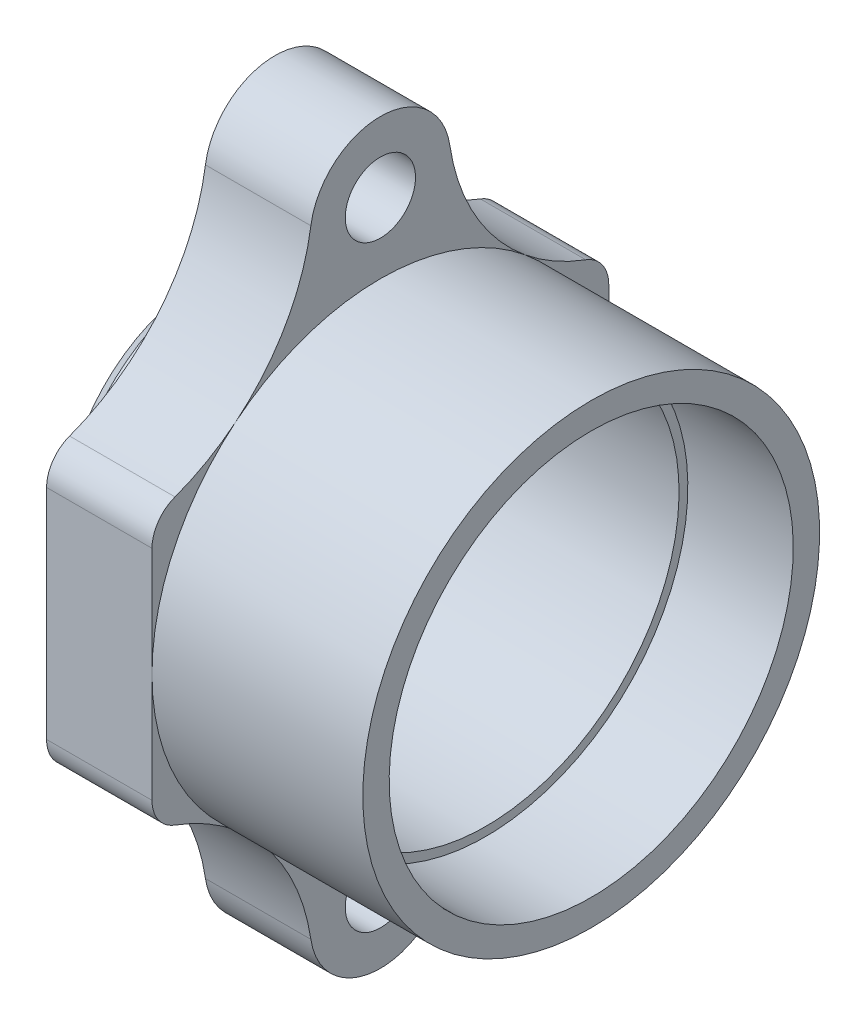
ISO-10303-21;
HEADER;
FILE_DESCRIPTION(('STEP AP214'),'2;1');
FILE_NAME('part.step','',(''),(''),'','','');
FILE_SCHEMA(('AUTOMOTIVE_DESIGN { 1 0 10303 214 1 1 1 1 }'));
ENDSEC;
DATA;
#1=APPLICATION_CONTEXT('core data for automotive mechanical design processes');
#2=APPLICATION_PROTOCOL_DEFINITION('international standard','automotive_design',2000,#1);
#3=PRODUCT_CONTEXT('',#1,'mechanical');
#4=PRODUCT('Part','Part','',(#3));
#5=PRODUCT_RELATED_PRODUCT_CATEGORY('part','',(#4));
#6=PRODUCT_DEFINITION_FORMATION('','',#4);
#7=PRODUCT_DEFINITION_CONTEXT('part definition',#1,'design');
#8=PRODUCT_DEFINITION('design','',#6,#7);
#9=PRODUCT_DEFINITION_SHAPE('','',#8);
#10=(LENGTH_UNIT() NAMED_UNIT(*) SI_UNIT(.MILLI.,.METRE.));
#11=(NAMED_UNIT(*) PLANE_ANGLE_UNIT() SI_UNIT($,.RADIAN.));
#12=(NAMED_UNIT(*) SI_UNIT($,.STERADIAN.) SOLID_ANGLE_UNIT());
#13=UNCERTAINTY_MEASURE_WITH_UNIT(LENGTH_MEASURE(1.E-05),#10,'distance_accuracy_value','');
#14=(GEOMETRIC_REPRESENTATION_CONTEXT(3) GLOBAL_UNCERTAINTY_ASSIGNED_CONTEXT((#13)) GLOBAL_UNIT_ASSIGNED_CONTEXT((#10,
#11,#12)) REPRESENTATION_CONTEXT('',''));
#15=CARTESIAN_POINT('',(0.,0.,0.));
#16=DIRECTION('',(0.,0.,1.));
#17=DIRECTION('',(1.,0.,0.));
#18=AXIS2_PLACEMENT_3D('',#15,#16,#17);
#19=CARTESIAN_POINT('',(-3.3,4.25,0.));
#20=DIRECTION('',(-1.,0.,0.));
#21=DIRECTION('',(0.,-1.,0.));
#22=AXIS2_PLACEMENT_3D('',#19,#20,#21);
#23=PLANE('',#22);
#24=CARTESIAN_POINT('',(-3.3,6.25,0.));
#25=DIRECTION('',(-1.,0.,0.));
#26=DIRECTION('',(0.,1.,0.));
#27=AXIS2_PLACEMENT_3D('',#24,#25,#26);
#28=CIRCLE('',#27,2.);
#29=CARTESIAN_POINT('',(-3.3,6.54411764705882,1.97825549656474));
#30=VERTEX_POINT('',#29);
#31=CARTESIAN_POINT('',(-3.3,6.54411764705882,-1.97825549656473));
#32=VERTEX_POINT('',#31);
#33=EDGE_CURVE('E183',#30,#32,#28,.T.);
#34=ORIENTED_EDGE('',*,*,#33,.T.);
#35=CARTESIAN_POINT('',(-3.3,7.4264705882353,-7.91302198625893));
#36=DIRECTION('',(1.,0.,0.));
#37=DIRECTION('',(0.,-1.,0.));
#38=AXIS2_PLACEMENT_3D('',#35,#36,#37);
#39=CIRCLE('',#38,6.);
#40=CARTESIAN_POINT('',(-3.3,1.7942315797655,-5.84471742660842));
#41=VERTEX_POINT('',#40);
#42=EDGE_CURVE('E156',#32,#41,#39,.T.);
#43=ORIENTED_EDGE('',*,*,#42,.T.);
#44=CARTESIAN_POINT('',(-3.3,0.855525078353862,-5.5));
#45=DIRECTION('',(-1.,0.,0.));
#46=DIRECTION('',(0.,1.,0.));
#47=AXIS2_PLACEMENT_3D('',#44,#45,#46);
#48=CIRCLE('',#47,1.);
#49=CARTESIAN_POINT('',(-3.3,0.855525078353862,-6.5));
#50=VERTEX_POINT('',#49);
#51=EDGE_CURVE('E136',#41,#50,#48,.T.);
#52=ORIENTED_EDGE('',*,*,#51,.T.);
#53=DIRECTION('',(0.,-1.,0.));
#54=VECTOR('',#53,1.);
#55=CARTESIAN_POINT('',(-3.3,0.855525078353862,-6.5));
#56=LINE('',#55,#54);
#57=CARTESIAN_POINT('',(-3.3,-5.35552507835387,-6.5));
#58=VERTEX_POINT('',#57);
#59=EDGE_CURVE('E146',#50,#58,#56,.T.);
#60=ORIENTED_EDGE('',*,*,#59,.T.);
#61=CARTESIAN_POINT('',(-3.3,-5.35552507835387,-5.5));
#62=DIRECTION('',(-1.,0.,0.));
#63=DIRECTION('',(0.,-1.,0.));
#64=AXIS2_PLACEMENT_3D('',#61,#62,#63);
#65=CIRCLE('',#64,1.);
#66=CARTESIAN_POINT('',(-3.3,-6.2942315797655,-5.84471742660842));
#67=VERTEX_POINT('',#66);
#68=EDGE_CURVE('E152',#58,#67,#65,.T.);
#69=ORIENTED_EDGE('',*,*,#68,.T.);
#70=CARTESIAN_POINT('',(-3.3,-11.9264705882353,-7.91302198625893));
#71=DIRECTION('',(1.,0.,0.));
#72=DIRECTION('',(0.,1.,0.));
#73=AXIS2_PLACEMENT_3D('',#70,#71,#72);
#74=CIRCLE('',#73,6.);
#75=CARTESIAN_POINT('',(-3.3,-11.0441176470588,-1.97825549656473));
#76=VERTEX_POINT('',#75);
#77=EDGE_CURVE('E166',#67,#76,#74,.T.);
#78=ORIENTED_EDGE('',*,*,#77,.T.);
#79=CARTESIAN_POINT('',(-3.3,-10.75,0.));
#80=DIRECTION('',(-1.,0.,0.));
#81=DIRECTION('',(0.,-1.,0.));
#82=AXIS2_PLACEMENT_3D('',#79,#80,#81);
#83=CIRCLE('',#82,2.);
#84=CARTESIAN_POINT('',(-3.3,-11.0441176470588,1.97825549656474));
#85=VERTEX_POINT('',#84);
#86=EDGE_CURVE('E168',#76,#85,#83,.T.);
#87=ORIENTED_EDGE('',*,*,#86,.T.);
#88=CARTESIAN_POINT('',(-3.3,-11.9264705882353,7.91302198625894));
#89=DIRECTION('',(1.,0.,0.));
#90=DIRECTION('',(0.,-1.,0.));
#91=AXIS2_PLACEMENT_3D('',#88,#89,#90);
#92=CIRCLE('',#91,6.);
#93=CARTESIAN_POINT('',(-3.3,-6.2942315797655,5.84471742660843));
#94=VERTEX_POINT('',#93);
#95=EDGE_CURVE('E171',#85,#94,#92,.T.);
#96=ORIENTED_EDGE('',*,*,#95,.T.);
#97=CARTESIAN_POINT('',(-3.3,-5.35552507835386,5.5));
#98=DIRECTION('',(-1.,0.,0.));
#99=DIRECTION('',(0.,1.,0.));
#100=AXIS2_PLACEMENT_3D('',#97,#98,#99);
#101=CIRCLE('',#100,1.);
#102=CARTESIAN_POINT('',(-3.3,-5.35552507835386,6.5));
#103=VERTEX_POINT('',#102);
#104=EDGE_CURVE('E173',#94,#103,#101,.T.);
#105=ORIENTED_EDGE('',*,*,#104,.T.);
#106=DIRECTION('',(0.,1.,0.));
#107=VECTOR('',#106,1.);
#108=CARTESIAN_POINT('',(-3.3,0.85552507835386,6.5));
#109=LINE('',#108,#107);
#110=CARTESIAN_POINT('',(-3.3,0.85552507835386,6.5));
#111=VERTEX_POINT('',#110);
#112=EDGE_CURVE('E176',#103,#111,#109,.T.);
#113=ORIENTED_EDGE('',*,*,#112,.T.);
#114=CARTESIAN_POINT('',(-3.3,0.85552507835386,5.5));
#115=DIRECTION('',(-1.,0.,0.));
#116=DIRECTION('',(0.,-1.,0.));
#117=AXIS2_PLACEMENT_3D('',#114,#115,#116);
#118=CIRCLE('',#117,1.);
#119=CARTESIAN_POINT('',(-3.3,1.79423157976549,5.84471742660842));
#120=VERTEX_POINT('',#119);
#121=EDGE_CURVE('E178',#111,#120,#118,.T.);
#122=ORIENTED_EDGE('',*,*,#121,.T.);
#123=CARTESIAN_POINT('',(-3.3,7.42647058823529,7.91302198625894));
#124=DIRECTION('',(1.,0.,0.));
#125=DIRECTION('',(0.,1.,0.));
#126=AXIS2_PLACEMENT_3D('',#123,#124,#125);
#127=CIRCLE('',#126,6.);
#128=EDGE_CURVE('E181',#120,#30,#127,.T.);
#129=ORIENTED_EDGE('',*,*,#128,.T.);
#130=EDGE_LOOP('',(#34,#43,#52,#60,#69,#78,#87,#96,#105,#113,#122,#129));
#131=FACE_BOUND('',#130,.T.);
#132=CARTESIAN_POINT('',(-3.3,6.25,0.));
#133=DIRECTION('',(-1.,0.,0.));
#134=DIRECTION('',(0.,1.,0.));
#135=AXIS2_PLACEMENT_3D('',#132,#133,#134);
#136=CIRCLE('',#135,0.999999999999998);
#137=CARTESIAN_POINT('',(-3.3,7.25,0.));
#138=VERTEX_POINT('',#137);
#139=EDGE_CURVE('E506',#138,#138,#136,.T.);
#140=ORIENTED_EDGE('',*,*,#139,.F.);
#141=EDGE_LOOP('',(#140));
#142=FACE_BOUND('',#141,.T.);
#143=CARTESIAN_POINT('',(-3.3,-10.75,0.));
#144=DIRECTION('',(-1.,0.,0.));
#145=DIRECTION('',(0.,-1.,0.));
#146=AXIS2_PLACEMENT_3D('',#143,#144,#145);
#147=CIRCLE('',#146,0.999999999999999);
#148=CARTESIAN_POINT('',(-3.3,-11.75,0.));
#149=VERTEX_POINT('',#148);
#150=EDGE_CURVE('E161',#149,#149,#147,.T.);
#151=ORIENTED_EDGE('',*,*,#150,.F.);
#152=EDGE_LOOP('',(#151));
#153=FACE_BOUND('',#152,.T.);
#154=CARTESIAN_POINT('',(-3.3,-2.25,0.));
#155=DIRECTION('',(1.,0.,0.));
#156=DIRECTION('',(0.,1.,0.));
#157=AXIS2_PLACEMENT_3D('',#154,#155,#156);
#158=CIRCLE('',#157,4.5);
#159=CARTESIAN_POINT('',(-3.3,2.25,0.));
#160=VERTEX_POINT('',#159);
#161=EDGE_CURVE('E255',#160,#160,#158,.T.);
#162=ORIENTED_EDGE('',*,*,#161,.T.);
#163=EDGE_LOOP('',(#162));
#164=FACE_BOUND('',#163,.T.);
#165=ADVANCED_FACE('F27',(#131,#142,#153,#164),#23,.T.);
#166=CARTESIAN_POINT('',(8.31355509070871,-2.25,0.));
#167=DIRECTION('',(1.,0.,0.));
#168=DIRECTION('',(0.,1.,0.));
#169=AXIS2_PLACEMENT_3D('',#166,#167,#168);
#170=CYLINDRICAL_SURFACE('',#169,6.5);
#171=CARTESIAN_POINT('',(-0.300000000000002,-2.25,0.));
#172=DIRECTION('',(1.,0.,0.));
#173=DIRECTION('',(0.,1.,0.));
#174=AXIS2_PLACEMENT_3D('',#171,#172,#173);
#175=CIRCLE('',#174,6.5);
#176=CARTESIAN_POINT('',(-0.300000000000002,2.78176470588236,-4.11477143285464));
#177=VERTEX_POINT('',#176);
#178=CARTESIAN_POINT('',(-0.300000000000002,-2.25,-6.5));
#179=VERTEX_POINT('',#178);
#180=EDGE_CURVE('E254',#177,#179,#175,.F.);
#181=ORIENTED_EDGE('',*,*,#180,.F.);
#182=CARTESIAN_POINT('',(-0.300000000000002,2.78176470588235,4.11477143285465));
#183=VERTEX_POINT('',#182);
#184=EDGE_CURVE('E226',#183,#177,#175,.F.);
#185=ORIENTED_EDGE('',*,*,#184,.F.);
#186=CARTESIAN_POINT('',(-0.300000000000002,-2.25,6.5));
#187=VERTEX_POINT('',#186);
#188=EDGE_CURVE('E253',#187,#183,#175,.F.);
#189=ORIENTED_EDGE('',*,*,#188,.F.);
#190=CARTESIAN_POINT('',(-0.3,-7.28176470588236,4.11477143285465));
#191=VERTEX_POINT('',#190);
#192=EDGE_CURVE('E533',#191,#187,#175,.F.);
#193=ORIENTED_EDGE('',*,*,#192,.F.);
#194=CARTESIAN_POINT('',(-0.3,-7.28176470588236,-4.11477143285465));
#195=VERTEX_POINT('',#194);
#196=EDGE_CURVE('E46',#195,#191,#175,.F.);
#197=ORIENTED_EDGE('',*,*,#196,.F.);
#198=EDGE_CURVE('E41',#179,#195,#175,.F.);
#199=ORIENTED_EDGE('',*,*,#198,.F.);
#200=EDGE_LOOP('',(#181,#185,#189,#193,#197,#199));
#201=FACE_BOUND('',#200,.T.);
#202=CARTESIAN_POINT('',(5.7,-2.25,0.));
#203=DIRECTION('',(1.,0.,0.));
#204=DIRECTION('',(0.,1.,0.));
#205=AXIS2_PLACEMENT_3D('',#202,#203,#204);
#206=CIRCLE('',#205,6.5);
#207=CARTESIAN_POINT('',(5.7,4.25,0.));
#208=VERTEX_POINT('',#207);
#209=EDGE_CURVE('E276',#208,#208,#206,.T.);
#210=ORIENTED_EDGE('',*,*,#209,.F.);
#211=EDGE_LOOP('',(#210));
#212=FACE_BOUND('',#211,.T.);
#213=ADVANCED_FACE('F301',(#201,#212),#170,.T.);
#214=CARTESIAN_POINT('',(5.7,4.25,0.));
#215=DIRECTION('',(1.,0.,0.));
#216=DIRECTION('',(0.,1.,0.));
#217=AXIS2_PLACEMENT_3D('',#214,#215,#216);
#218=PLANE('',#217);
#219=ORIENTED_EDGE('',*,*,#209,.T.);
#220=EDGE_LOOP('',(#219));
#221=FACE_BOUND('',#220,.T.);
#222=CARTESIAN_POINT('',(5.7,-2.25,0.));
#223=DIRECTION('',(1.,0.,0.));
#224=DIRECTION('',(0.,1.,0.));
#225=AXIS2_PLACEMENT_3D('',#222,#223,#224);
#226=CIRCLE('',#225,5.75);
#227=CARTESIAN_POINT('',(5.7,3.5,0.));
#228=VERTEX_POINT('',#227);
#229=EDGE_CURVE('E273',#228,#228,#226,.T.);
#230=ORIENTED_EDGE('',*,*,#229,.F.);
#231=EDGE_LOOP('',(#230));
#232=FACE_BOUND('',#231,.T.);
#233=ADVANCED_FACE('F305',(#221,#232),#218,.T.);
#234=CARTESIAN_POINT('',(8.31355509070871,-2.25,0.));
#235=DIRECTION('',(1.,0.,0.));
#236=DIRECTION('',(0.,1.,0.));
#237=AXIS2_PLACEMENT_3D('',#234,#235,#236);
#238=CYLINDRICAL_SURFACE('',#237,5.75);
#239=ORIENTED_EDGE('',*,*,#229,.T.);
#240=EDGE_LOOP('',(#239));
#241=FACE_BOUND('',#240,.T.);
#242=CARTESIAN_POINT('',(2.7,-2.25,0.));
#243=DIRECTION('',(1.,0.,0.));
#244=DIRECTION('',(0.,1.,0.));
#245=AXIS2_PLACEMENT_3D('',#242,#243,#244);
#246=CIRCLE('',#245,5.75);
#247=CARTESIAN_POINT('',(2.7,3.5,0.));
#248=VERTEX_POINT('',#247);
#249=EDGE_CURVE('E270',#248,#248,#246,.T.);
#250=ORIENTED_EDGE('',*,*,#249,.F.);
#251=EDGE_LOOP('',(#250));
#252=FACE_BOUND('',#251,.T.);
#253=ADVANCED_FACE('F310',(#241,#252),#238,.F.);
#254=CARTESIAN_POINT('',(2.7,3.5,0.));
#255=DIRECTION('',(1.,0.,0.));
#256=DIRECTION('',(0.,1.,0.));
#257=AXIS2_PLACEMENT_3D('',#254,#255,#256);
#258=PLANE('',#257);
#259=ORIENTED_EDGE('',*,*,#249,.T.);
#260=EDGE_LOOP('',(#259));
#261=FACE_BOUND('',#260,.T.);
#262=CARTESIAN_POINT('',(2.7,-2.25,0.));
#263=DIRECTION('',(1.,0.,0.));
#264=DIRECTION('',(0.,1.,0.));
#265=AXIS2_PLACEMENT_3D('',#262,#263,#264);
#266=CIRCLE('',#265,5.5);
#267=CARTESIAN_POINT('',(2.7,3.25,0.));
#268=VERTEX_POINT('',#267);
#269=EDGE_CURVE('E267',#268,#268,#266,.T.);
#270=ORIENTED_EDGE('',*,*,#269,.F.);
#271=EDGE_LOOP('',(#270));
#272=FACE_BOUND('',#271,.T.);
#273=ADVANCED_FACE('F317',(#261,#272),#258,.T.);
#274=CARTESIAN_POINT('',(8.31355509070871,-2.25,0.));
#275=DIRECTION('',(1.,0.,0.));
#276=DIRECTION('',(0.,1.,0.));
#277=AXIS2_PLACEMENT_3D('',#274,#275,#276);
#278=CYLINDRICAL_SURFACE('',#277,5.5);
#279=ORIENTED_EDGE('',*,*,#269,.T.);
#280=EDGE_LOOP('',(#279));
#281=FACE_BOUND('',#280,.T.);
#282=CARTESIAN_POINT('',(-2.3,-2.25,0.));
#283=DIRECTION('',(1.,0.,0.));
#284=DIRECTION('',(0.,1.,0.));
#285=AXIS2_PLACEMENT_3D('',#282,#283,#284);
#286=CIRCLE('',#285,5.5);
#287=CARTESIAN_POINT('',(-2.3,3.25,0.));
#288=VERTEX_POINT('',#287);
#289=EDGE_CURVE('E264',#288,#288,#286,.T.);
#290=ORIENTED_EDGE('',*,*,#289,.F.);
#291=EDGE_LOOP('',(#290));
#292=FACE_BOUND('',#291,.T.);
#293=ADVANCED_FACE('F321',(#281,#292),#278,.F.);
#294=CARTESIAN_POINT('',(-2.3,3.25,0.));
#295=DIRECTION('',(1.,0.,0.));
#296=DIRECTION('',(0.,1.,0.));
#297=AXIS2_PLACEMENT_3D('',#294,#295,#296);
#298=PLANE('',#297);
#299=ORIENTED_EDGE('',*,*,#289,.T.);
#300=EDGE_LOOP('',(#299));
#301=FACE_BOUND('',#300,.T.);
#302=CARTESIAN_POINT('',(-2.3,-2.25,0.));
#303=DIRECTION('',(1.,0.,0.));
#304=DIRECTION('',(0.,1.,0.));
#305=AXIS2_PLACEMENT_3D('',#302,#303,#304);
#306=CIRCLE('',#305,3.);
#307=CARTESIAN_POINT('',(-2.3,0.75,0.));
#308=VERTEX_POINT('',#307);
#309=EDGE_CURVE('E261',#308,#308,#306,.T.);
#310=ORIENTED_EDGE('',*,*,#309,.F.);
#311=EDGE_LOOP('',(#310));
#312=FACE_BOUND('',#311,.T.);
#313=ADVANCED_FACE('F324',(#301,#312),#298,.T.);
#314=CARTESIAN_POINT('',(8.31355509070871,-2.25,0.));
#315=DIRECTION('',(1.,0.,0.));
#316=DIRECTION('',(0.,1.,0.));
#317=AXIS2_PLACEMENT_3D('',#314,#315,#316);
#318=CYLINDRICAL_SURFACE('',#317,3.);
#319=ORIENTED_EDGE('',*,*,#309,.T.);
#320=EDGE_LOOP('',(#319));
#321=FACE_BOUND('',#320,.T.);
#322=CARTESIAN_POINT('',(-5.3,-2.25,0.));
#323=DIRECTION('',(1.,0.,0.));
#324=DIRECTION('',(0.,1.,0.));
#325=AXIS2_PLACEMENT_3D('',#322,#323,#324);
#326=CIRCLE('',#325,3.);
#327=CARTESIAN_POINT('',(-5.3,0.749999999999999,0.));
#328=VERTEX_POINT('',#327);
#329=EDGE_CURVE('E258',#328,#328,#326,.T.);
#330=ORIENTED_EDGE('',*,*,#329,.F.);
#331=EDGE_LOOP('',(#330));
#332=FACE_BOUND('',#331,.T.);
#333=ADVANCED_FACE('F328',(#321,#332),#318,.F.);
#334=CARTESIAN_POINT('',(-5.3,2.25,0.));
#335=DIRECTION('',(-1.,0.,0.));
#336=DIRECTION('',(0.,-1.,0.));
#337=AXIS2_PLACEMENT_3D('',#334,#335,#336);
#338=PLANE('',#337);
#339=CARTESIAN_POINT('',(-5.3,-2.25,0.));
#340=DIRECTION('',(-1.,0.,0.));
#341=DIRECTION('',(0.,-1.,0.));
#342=AXIS2_PLACEMENT_3D('',#339,#340,#341);
#343=CIRCLE('',#342,4.);
#344=CARTESIAN_POINT('',(-5.3,-6.25,0.));
#345=VERTEX_POINT('',#344);
#346=EDGE_CURVE('E11',#345,#345,#343,.T.);
#347=ORIENTED_EDGE('',*,*,#346,.T.);
#348=EDGE_LOOP('',(#347));
#349=FACE_BOUND('',#348,.T.);
#350=ORIENTED_EDGE('',*,*,#329,.T.);
#351=EDGE_LOOP('',(#350));
#352=FACE_BOUND('',#351,.T.);
#353=ADVANCED_FACE('F297',(#349,#352),#338,.T.);
#354=CARTESIAN_POINT('',(8.31355509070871,-2.25,0.));
#355=DIRECTION('',(1.,0.,0.));
#356=DIRECTION('',(0.,1.,0.));
#357=AXIS2_PLACEMENT_3D('',#354,#355,#356);
#358=CYLINDRICAL_SURFACE('',#357,4.5);
#359=CARTESIAN_POINT('',(-4.8,-2.25,0.));
#360=DIRECTION('',(-1.,0.,0.));
#361=DIRECTION('',(0.,0.,1.));
#362=AXIS2_PLACEMENT_3D('',#359,#360,#361);
#363=CIRCLE('',#362,4.5);
#364=CARTESIAN_POINT('',(-4.8,-2.25,4.5));
#365=VERTEX_POINT('',#364);
#366=EDGE_CURVE('E34',#365,#365,#363,.F.);
#367=ORIENTED_EDGE('',*,*,#366,.T.);
#368=EDGE_LOOP('',(#367));
#369=FACE_BOUND('',#368,.T.);
#370=ORIENTED_EDGE('',*,*,#161,.F.);
#371=EDGE_LOOP('',(#370));
#372=FACE_BOUND('',#371,.T.);
#373=ADVANCED_FACE('F281',(#369,#372),#358,.T.);
#374=CARTESIAN_POINT('',(-4.8,-2.25,0.));
#375=DIRECTION('',(1.,0.,0.));
#376=DIRECTION('',(0.,0.,-1.));
#377=AXIS2_PLACEMENT_3D('',#374,#375,#376);
#378=CONICAL_SURFACE('',#377,4.5,0.785398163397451);
#379=ORIENTED_EDGE('',*,*,#346,.F.);
#380=EDGE_LOOP('',(#379));
#381=FACE_BOUND('',#380,.T.);
#382=ORIENTED_EDGE('',*,*,#366,.F.);
#383=EDGE_LOOP('',(#382));
#384=FACE_BOUND('',#383,.T.);
#385=ADVANCED_FACE('F284',(#381,#384),#378,.T.);
#386=CARTESIAN_POINT('',(-0.300000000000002,7.4264705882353,-7.91302198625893));
#387=DIRECTION('',(-1.,0.,0.));
#388=DIRECTION('',(0.,-1.,0.));
#389=AXIS2_PLACEMENT_3D('',#386,#387,#388);
#390=CYLINDRICAL_SURFACE('',#389,6.);
#391=ORIENTED_EDGE('',*,*,#42,.F.);
#392=DIRECTION('',(-1.,0.,0.));
#393=VECTOR('',#392,1.);
#394=CARTESIAN_POINT('',(-0.300000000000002,6.54411764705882,-1.97825549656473));
#395=LINE('',#394,#393);
#396=CARTESIAN_POINT('',(-0.300000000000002,6.54411764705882,-1.97825549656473));
#397=VERTEX_POINT('',#396);
#398=EDGE_CURVE('E227',#397,#32,#395,.T.);
#399=ORIENTED_EDGE('',*,*,#398,.F.);
#400=CARTESIAN_POINT('',(-0.300000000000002,7.4264705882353,-7.91302198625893));
#401=DIRECTION('',(1.,0.,0.));
#402=DIRECTION('',(0.,-1.,0.));
#403=AXIS2_PLACEMENT_3D('',#400,#401,#402);
#404=CIRCLE('',#403,6.);
#405=EDGE_CURVE('E143',#397,#177,#404,.T.);
#406=ORIENTED_EDGE('',*,*,#405,.T.);
#407=CARTESIAN_POINT('',(-0.300000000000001,1.7942315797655,-5.84471742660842));
#408=VERTEX_POINT('',#407);
#409=EDGE_CURVE('E221',#177,#408,#404,.T.);
#410=ORIENTED_EDGE('',*,*,#409,.T.);
#411=DIRECTION('',(-1.,0.,0.));
#412=VECTOR('',#411,1.);
#413=CARTESIAN_POINT('',(-0.300000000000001,1.7942315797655,-5.84471742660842));
#414=LINE('',#413,#412);
#415=EDGE_CURVE('E224',#408,#41,#414,.T.);
#416=ORIENTED_EDGE('',*,*,#415,.T.);
#417=EDGE_LOOP('',(#391,#399,#406,#410,#416));
#418=FACE_BOUND('',#417,.T.);
#419=ADVANCED_FACE('F286',(#418),#390,.F.);
#420=CARTESIAN_POINT('',(-0.300000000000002,7.42647058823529,7.91302198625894));
#421=DIRECTION('',(-1.,0.,0.));
#422=DIRECTION('',(0.,-1.,0.));
#423=AXIS2_PLACEMENT_3D('',#420,#421,#422);
#424=CYLINDRICAL_SURFACE('',#423,6.);
#425=DIRECTION('',(-1.,0.,0.));
#426=VECTOR('',#425,1.);
#427=CARTESIAN_POINT('',(-0.300000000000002,6.54411764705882,1.97825549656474));
#428=LINE('',#427,#426);
#429=CARTESIAN_POINT('',(-0.300000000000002,6.54411764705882,1.97825549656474));
#430=VERTEX_POINT('',#429);
#431=EDGE_CURVE('E230',#430,#30,#428,.T.);
#432=ORIENTED_EDGE('',*,*,#431,.T.);
#433=ORIENTED_EDGE('',*,*,#128,.F.);
#434=DIRECTION('',(-1.,0.,0.));
#435=VECTOR('',#434,1.);
#436=CARTESIAN_POINT('',(-0.300000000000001,1.79423157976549,5.84471742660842));
#437=LINE('',#436,#435);
#438=CARTESIAN_POINT('',(-0.300000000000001,1.79423157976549,5.84471742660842));
#439=VERTEX_POINT('',#438);
#440=EDGE_CURVE('E233',#439,#120,#437,.T.);
#441=ORIENTED_EDGE('',*,*,#440,.F.);
#442=CARTESIAN_POINT('',(-0.300000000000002,7.42647058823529,7.91302198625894));
#443=DIRECTION('',(1.,0.,0.));
#444=DIRECTION('',(0.,1.,0.));
#445=AXIS2_PLACEMENT_3D('',#442,#443,#444);
#446=CIRCLE('',#445,6.);
#447=EDGE_CURVE('E215',#439,#183,#446,.T.);
#448=ORIENTED_EDGE('',*,*,#447,.T.);
#449=EDGE_CURVE('E214',#183,#430,#446,.T.);
#450=ORIENTED_EDGE('',*,*,#449,.T.);
#451=EDGE_LOOP('',(#432,#433,#441,#448,#450));
#452=FACE_BOUND('',#451,.T.);
#453=ADVANCED_FACE('F294',(#452),#424,.F.);
#454=CARTESIAN_POINT('',(-0.300000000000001,0.855525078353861,6.5));
#455=DIRECTION('',(0.,0.,1.));
#456=DIRECTION('',(1.,0.,0.));
#457=AXIS2_PLACEMENT_3D('',#454,#455,#456);
#458=PLANE('',#457);
#459=DIRECTION('',(-1.,0.,0.));
#460=VECTOR('',#459,1.);
#461=CARTESIAN_POINT('',(-0.300000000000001,0.855525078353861,6.5));
#462=LINE('',#461,#460);
#463=CARTESIAN_POINT('',(-0.300000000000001,0.855525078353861,6.5));
#464=VERTEX_POINT('',#463);
#465=EDGE_CURVE('E235',#464,#111,#462,.T.);
#466=ORIENTED_EDGE('',*,*,#465,.T.);
#467=ORIENTED_EDGE('',*,*,#112,.F.);
#468=DIRECTION('',(-1.,0.,0.));
#469=VECTOR('',#468,1.);
#470=CARTESIAN_POINT('',(-0.3,-5.35552507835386,6.5));
#471=LINE('',#470,#469);
#472=CARTESIAN_POINT('',(-0.3,-5.35552507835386,6.5));
#473=VERTEX_POINT('',#472);
#474=EDGE_CURVE('E238',#473,#103,#471,.T.);
#475=ORIENTED_EDGE('',*,*,#474,.F.);
#476=DIRECTION('',(0.,1.,0.));
#477=VECTOR('',#476,1.);
#478=CARTESIAN_POINT('',(-0.300000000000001,0.855525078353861,6.5));
#479=LINE('',#478,#477);
#480=EDGE_CURVE('E208',#473,#187,#479,.T.);
#481=ORIENTED_EDGE('',*,*,#480,.T.);
#482=EDGE_CURVE('E207',#187,#464,#479,.T.);
#483=ORIENTED_EDGE('',*,*,#482,.T.);
#484=EDGE_LOOP('',(#466,#467,#475,#481,#483));
#485=FACE_BOUND('',#484,.T.);
#486=ADVANCED_FACE('F364',(#485),#458,.T.);
#487=CARTESIAN_POINT('',(-0.299999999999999,-11.9264705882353,7.91302198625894));
#488=DIRECTION('',(-1.,0.,0.));
#489=DIRECTION('',(0.,-1.,0.));
#490=AXIS2_PLACEMENT_3D('',#487,#488,#489);
#491=CYLINDRICAL_SURFACE('',#490,6.);
#492=DIRECTION('',(-1.,0.,0.));
#493=VECTOR('',#492,1.);
#494=CARTESIAN_POINT('',(-0.3,-6.2942315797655,5.84471742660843));
#495=LINE('',#494,#493);
#496=CARTESIAN_POINT('',(-0.3,-6.2942315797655,5.84471742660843));
#497=VERTEX_POINT('',#496);
#498=EDGE_CURVE('E240',#497,#94,#495,.T.);
#499=ORIENTED_EDGE('',*,*,#498,.T.);
#500=ORIENTED_EDGE('',*,*,#95,.F.);
#501=DIRECTION('',(-1.,0.,0.));
#502=VECTOR('',#501,1.);
#503=CARTESIAN_POINT('',(-0.3,-11.0441176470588,1.97825549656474));
#504=LINE('',#503,#502);
#505=CARTESIAN_POINT('',(-0.3,-11.0441176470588,1.97825549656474));
#506=VERTEX_POINT('',#505);
#507=EDGE_CURVE('E243',#506,#85,#504,.T.);
#508=ORIENTED_EDGE('',*,*,#507,.F.);
#509=CARTESIAN_POINT('',(-0.299999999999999,-11.9264705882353,7.91302198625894));
#510=DIRECTION('',(1.,0.,0.));
#511=DIRECTION('',(0.,-1.,0.));
#512=AXIS2_PLACEMENT_3D('',#509,#510,#511);
#513=CIRCLE('',#512,6.);
#514=EDGE_CURVE('E201',#506,#191,#513,.T.);
#515=ORIENTED_EDGE('',*,*,#514,.T.);
#516=EDGE_CURVE('E200',#191,#497,#513,.T.);
#517=ORIENTED_EDGE('',*,*,#516,.T.);
#518=EDGE_LOOP('',(#499,#500,#508,#515,#517));
#519=FACE_BOUND('',#518,.T.);
#520=ADVANCED_FACE('F372',(#519),#491,.F.);
#521=CARTESIAN_POINT('',(-0.299999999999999,-11.9264705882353,-7.91302198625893));
#522=DIRECTION('',(-1.,0.,0.));
#523=DIRECTION('',(0.,-1.,0.));
#524=AXIS2_PLACEMENT_3D('',#521,#522,#523);
#525=CYLINDRICAL_SURFACE('',#524,6.);
#526=DIRECTION('',(-1.,0.,0.));
#527=VECTOR('',#526,1.);
#528=CARTESIAN_POINT('',(-0.299999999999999,-11.0441176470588,-1.97825549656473));
#529=LINE('',#528,#527);
#530=CARTESIAN_POINT('',(-0.299999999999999,-11.0441176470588,-1.97825549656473));
#531=VERTEX_POINT('',#530);
#532=EDGE_CURVE('E245',#531,#76,#529,.T.);
#533=ORIENTED_EDGE('',*,*,#532,.T.);
#534=ORIENTED_EDGE('',*,*,#77,.F.);
#535=DIRECTION('',(-1.,0.,0.));
#536=VECTOR('',#535,1.);
#537=CARTESIAN_POINT('',(-0.3,-6.2942315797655,-5.84471742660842));
#538=LINE('',#537,#536);
#539=CARTESIAN_POINT('',(-0.3,-6.2942315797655,-5.84471742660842));
#540=VERTEX_POINT('',#539);
#541=EDGE_CURVE('E248',#540,#67,#538,.T.);
#542=ORIENTED_EDGE('',*,*,#541,.F.);
#543=CARTESIAN_POINT('',(-0.299999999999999,-11.9264705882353,-7.91302198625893));
#544=DIRECTION('',(1.,0.,0.));
#545=DIRECTION('',(0.,1.,0.));
#546=AXIS2_PLACEMENT_3D('',#543,#544,#545);
#547=CIRCLE('',#546,6.);
#548=EDGE_CURVE('E194',#540,#195,#547,.T.);
#549=ORIENTED_EDGE('',*,*,#548,.T.);
#550=EDGE_CURVE('E193',#195,#531,#547,.T.);
#551=ORIENTED_EDGE('',*,*,#550,.T.);
#552=EDGE_LOOP('',(#533,#534,#542,#549,#551));
#553=FACE_BOUND('',#552,.T.);
#554=ADVANCED_FACE('F380',(#553),#525,.F.);
#555=CARTESIAN_POINT('',(-0.300000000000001,0.855525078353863,-6.5));
#556=DIRECTION('',(0.,0.,-1.));
#557=DIRECTION('',(-1.,0.,0.));
#558=AXIS2_PLACEMENT_3D('',#555,#556,#557);
#559=PLANE('',#558);
#560=DIRECTION('',(-1.,0.,0.));
#561=VECTOR('',#560,1.);
#562=CARTESIAN_POINT('',(-0.3,-5.35552507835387,-6.5));
#563=LINE('',#562,#561);
#564=CARTESIAN_POINT('',(-0.3,-5.35552507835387,-6.5));
#565=VERTEX_POINT('',#564);
#566=EDGE_CURVE('E142',#565,#58,#563,.T.);
#567=ORIENTED_EDGE('',*,*,#566,.T.);
#568=ORIENTED_EDGE('',*,*,#59,.F.);
#569=DIRECTION('',(-1.,0.,0.));
#570=VECTOR('',#569,1.);
#571=CARTESIAN_POINT('',(-0.300000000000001,0.855525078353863,-6.5));
#572=LINE('',#571,#570);
#573=CARTESIAN_POINT('',(-0.300000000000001,0.855525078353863,-6.5));
#574=VERTEX_POINT('',#573);
#575=EDGE_CURVE('E131',#574,#50,#572,.T.);
#576=ORIENTED_EDGE('',*,*,#575,.F.);
#577=DIRECTION('',(0.,-1.,0.));
#578=VECTOR('',#577,1.);
#579=CARTESIAN_POINT('',(-0.300000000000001,0.855525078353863,-6.5));
#580=LINE('',#579,#578);
#581=EDGE_CURVE('E188',#574,#179,#580,.T.);
#582=ORIENTED_EDGE('',*,*,#581,.T.);
#583=EDGE_CURVE('E187',#179,#565,#580,.T.);
#584=ORIENTED_EDGE('',*,*,#583,.T.);
#585=EDGE_LOOP('',(#567,#568,#576,#582,#584));
#586=FACE_BOUND('',#585,.T.);
#587=ADVANCED_FACE('F147',(#586),#559,.T.);
#588=CARTESIAN_POINT('',(-0.300000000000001,0.855525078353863,-5.5));
#589=DIRECTION('',(1.,0.,0.));
#590=DIRECTION('',(0.,1.,0.));
#591=AXIS2_PLACEMENT_3D('',#588,#589,#590);
#592=PLANE('',#591);
#593=ORIENTED_EDGE('',*,*,#409,.F.);
#594=ORIENTED_EDGE('',*,*,#180,.T.);
#595=ORIENTED_EDGE('',*,*,#581,.F.);
#596=CARTESIAN_POINT('',(-0.300000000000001,0.855525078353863,-5.5));
#597=DIRECTION('',(-1.,0.,0.));
#598=DIRECTION('',(0.,1.,0.));
#599=AXIS2_PLACEMENT_3D('',#596,#597,#598);
#600=CIRCLE('',#599,1.);
#601=EDGE_CURVE('E138',#408,#574,#600,.T.);
#602=ORIENTED_EDGE('',*,*,#601,.F.);
#603=EDGE_LOOP('',(#593,#594,#595,#602));
#604=FACE_BOUND('',#603,.T.);
#605=ADVANCED_FACE('F395',(#604),#592,.T.);
#606=ORIENTED_EDGE('',*,*,#583,.F.);
#607=ORIENTED_EDGE('',*,*,#198,.T.);
#608=ORIENTED_EDGE('',*,*,#548,.F.);
#609=CARTESIAN_POINT('',(-0.3,-5.35552507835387,-5.5));
#610=DIRECTION('',(-1.,0.,0.));
#611=DIRECTION('',(0.,-1.,0.));
#612=AXIS2_PLACEMENT_3D('',#609,#610,#611);
#613=CIRCLE('',#612,1.);
#614=EDGE_CURVE('E190',#565,#540,#613,.T.);
#615=ORIENTED_EDGE('',*,*,#614,.F.);
#616=EDGE_LOOP('',(#606,#607,#608,#615));
#617=FACE_BOUND('',#616,.T.);
#618=ADVANCED_FACE('F402',(#617),#592,.T.);
#619=CARTESIAN_POINT('',(-0.3,-10.75,0.));
#620=DIRECTION('',(-1.,0.,0.));
#621=DIRECTION('',(0.,-1.,0.));
#622=AXIS2_PLACEMENT_3D('',#619,#620,#621);
#623=CIRCLE('',#622,0.999999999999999);
#624=CARTESIAN_POINT('',(-0.3,-11.75,0.));
#625=VERTEX_POINT('',#624);
#626=EDGE_CURVE('E158',#625,#625,#623,.T.);
#627=ORIENTED_EDGE('',*,*,#626,.T.);
#628=EDGE_LOOP('',(#627));
#629=FACE_BOUND('',#628,.T.);
#630=ORIENTED_EDGE('',*,*,#550,.F.);
#631=ORIENTED_EDGE('',*,*,#196,.T.);
#632=ORIENTED_EDGE('',*,*,#514,.F.);
#633=CARTESIAN_POINT('',(-0.3,-10.75,0.));
#634=DIRECTION('',(-1.,0.,0.));
#635=DIRECTION('',(0.,-1.,0.));
#636=AXIS2_PLACEMENT_3D('',#633,#634,#635);
#637=CIRCLE('',#636,2.);
#638=EDGE_CURVE('E197',#531,#506,#637,.T.);
#639=ORIENTED_EDGE('',*,*,#638,.F.);
#640=EDGE_LOOP('',(#630,#631,#632,#639));
#641=FACE_BOUND('',#640,.T.);
#642=ADVANCED_FACE('F411',(#629,#641),#592,.T.);
#643=ORIENTED_EDGE('',*,*,#516,.F.);
#644=ORIENTED_EDGE('',*,*,#192,.T.);
#645=ORIENTED_EDGE('',*,*,#480,.F.);
#646=CARTESIAN_POINT('',(-0.3,-5.35552507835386,5.5));
#647=DIRECTION('',(-1.,0.,0.));
#648=DIRECTION('',(0.,1.,0.));
#649=AXIS2_PLACEMENT_3D('',#646,#647,#648);
#650=CIRCLE('',#649,1.);
#651=EDGE_CURVE('E204',#497,#473,#650,.T.);
#652=ORIENTED_EDGE('',*,*,#651,.F.);
#653=EDGE_LOOP('',(#643,#644,#645,#652));
#654=FACE_BOUND('',#653,.T.);
#655=ADVANCED_FACE('F418',(#654),#592,.T.);
#656=ORIENTED_EDGE('',*,*,#482,.F.);
#657=ORIENTED_EDGE('',*,*,#188,.T.);
#658=ORIENTED_EDGE('',*,*,#447,.F.);
#659=CARTESIAN_POINT('',(-0.300000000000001,0.855525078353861,5.5));
#660=DIRECTION('',(-1.,0.,0.));
#661=DIRECTION('',(0.,-1.,0.));
#662=AXIS2_PLACEMENT_3D('',#659,#660,#661);
#663=CIRCLE('',#662,1.);
#664=EDGE_CURVE('E211',#464,#439,#663,.T.);
#665=ORIENTED_EDGE('',*,*,#664,.F.);
#666=EDGE_LOOP('',(#656,#657,#658,#665));
#667=FACE_BOUND('',#666,.T.);
#668=ADVANCED_FACE('F425',(#667),#592,.T.);
#669=CARTESIAN_POINT('',(-0.300000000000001,0.855525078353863,-5.5));
#670=DIRECTION('',(-1.,0.,0.));
#671=DIRECTION('',(0.,-1.,0.));
#672=AXIS2_PLACEMENT_3D('',#669,#670,#671);
#673=CYLINDRICAL_SURFACE('',#672,1.);
#674=ORIENTED_EDGE('',*,*,#51,.F.);
#675=ORIENTED_EDGE('',*,*,#415,.F.);
#676=ORIENTED_EDGE('',*,*,#601,.T.);
#677=ORIENTED_EDGE('',*,*,#575,.T.);
#678=EDGE_LOOP('',(#674,#675,#676,#677));
#679=FACE_BOUND('',#678,.T.);
#680=ADVANCED_FACE('F133',(#679),#673,.T.);
#681=CARTESIAN_POINT('',(-0.300000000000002,6.25,0.));
#682=DIRECTION('',(-1.,0.,0.));
#683=DIRECTION('',(0.,-1.,0.));
#684=AXIS2_PLACEMENT_3D('',#681,#682,#683);
#685=CYLINDRICAL_SURFACE('',#684,2.);
#686=ORIENTED_EDGE('',*,*,#33,.F.);
#687=ORIENTED_EDGE('',*,*,#431,.F.);
#688=CARTESIAN_POINT('',(-0.300000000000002,6.25,0.));
#689=DIRECTION('',(-1.,0.,0.));
#690=DIRECTION('',(0.,1.,0.));
#691=AXIS2_PLACEMENT_3D('',#688,#689,#690);
#692=CIRCLE('',#691,2.);
#693=EDGE_CURVE('E218',#430,#397,#692,.T.);
#694=ORIENTED_EDGE('',*,*,#693,.T.);
#695=ORIENTED_EDGE('',*,*,#398,.T.);
#696=EDGE_LOOP('',(#686,#687,#694,#695));
#697=FACE_BOUND('',#696,.T.);
#698=ADVANCED_FACE('F438',(#697),#685,.T.);
#699=CARTESIAN_POINT('',(-0.300000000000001,0.855525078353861,5.5));
#700=DIRECTION('',(-1.,0.,0.));
#701=DIRECTION('',(0.,-1.,0.));
#702=AXIS2_PLACEMENT_3D('',#699,#700,#701);
#703=CYLINDRICAL_SURFACE('',#702,1.);
#704=ORIENTED_EDGE('',*,*,#121,.F.);
#705=ORIENTED_EDGE('',*,*,#465,.F.);
#706=ORIENTED_EDGE('',*,*,#664,.T.);
#707=ORIENTED_EDGE('',*,*,#440,.T.);
#708=EDGE_LOOP('',(#704,#705,#706,#707));
#709=FACE_BOUND('',#708,.T.);
#710=ADVANCED_FACE('F444',(#709),#703,.T.);
#711=CARTESIAN_POINT('',(-0.3,-5.35552507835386,5.5));
#712=DIRECTION('',(-1.,0.,0.));
#713=DIRECTION('',(0.,-1.,0.));
#714=AXIS2_PLACEMENT_3D('',#711,#712,#713);
#715=CYLINDRICAL_SURFACE('',#714,1.);
#716=ORIENTED_EDGE('',*,*,#104,.F.);
#717=ORIENTED_EDGE('',*,*,#498,.F.);
#718=ORIENTED_EDGE('',*,*,#651,.T.);
#719=ORIENTED_EDGE('',*,*,#474,.T.);
#720=EDGE_LOOP('',(#716,#717,#718,#719));
#721=FACE_BOUND('',#720,.T.);
#722=ADVANCED_FACE('F452',(#721),#715,.T.);
#723=CARTESIAN_POINT('',(-0.3,-10.75,0.));
#724=DIRECTION('',(-1.,0.,0.));
#725=DIRECTION('',(0.,-1.,0.));
#726=AXIS2_PLACEMENT_3D('',#723,#724,#725);
#727=CYLINDRICAL_SURFACE('',#726,2.);
#728=ORIENTED_EDGE('',*,*,#86,.F.);
#729=ORIENTED_EDGE('',*,*,#532,.F.);
#730=ORIENTED_EDGE('',*,*,#638,.T.);
#731=ORIENTED_EDGE('',*,*,#507,.T.);
#732=EDGE_LOOP('',(#728,#729,#730,#731));
#733=FACE_BOUND('',#732,.T.);
#734=ADVANCED_FACE('F460',(#733),#727,.T.);
#735=CARTESIAN_POINT('',(-0.3,-5.35552507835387,-5.5));
#736=DIRECTION('',(-1.,0.,0.));
#737=DIRECTION('',(0.,-1.,0.));
#738=AXIS2_PLACEMENT_3D('',#735,#736,#737);
#739=CYLINDRICAL_SURFACE('',#738,1.);
#740=ORIENTED_EDGE('',*,*,#68,.F.);
#741=ORIENTED_EDGE('',*,*,#566,.F.);
#742=ORIENTED_EDGE('',*,*,#614,.T.);
#743=ORIENTED_EDGE('',*,*,#541,.T.);
#744=EDGE_LOOP('',(#740,#741,#742,#743));
#745=FACE_BOUND('',#744,.T.);
#746=ADVANCED_FACE('F468',(#745),#739,.T.);
#747=CARTESIAN_POINT('',(-0.300000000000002,6.25,0.));
#748=DIRECTION('',(-1.,0.,0.));
#749=DIRECTION('',(0.,1.,0.));
#750=AXIS2_PLACEMENT_3D('',#747,#748,#749);
#751=CIRCLE('',#750,0.999999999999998);
#752=CARTESIAN_POINT('',(-0.300000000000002,7.25,0.));
#753=VERTEX_POINT('',#752);
#754=EDGE_CURVE('E503',#753,#753,#751,.T.);
#755=ORIENTED_EDGE('',*,*,#754,.T.);
#756=EDGE_LOOP('',(#755));
#757=FACE_BOUND('',#756,.T.);
#758=ORIENTED_EDGE('',*,*,#449,.F.);
#759=ORIENTED_EDGE('',*,*,#184,.T.);
#760=ORIENTED_EDGE('',*,*,#405,.F.);
#761=ORIENTED_EDGE('',*,*,#693,.F.);
#762=EDGE_LOOP('',(#758,#759,#760,#761));
#763=FACE_BOUND('',#762,.T.);
#764=ADVANCED_FACE('F405',(#757,#763),#592,.T.);
#765=CARTESIAN_POINT('',(-0.3,-10.75,0.));
#766=DIRECTION('',(-1.,0.,0.));
#767=DIRECTION('',(0.,-1.,0.));
#768=AXIS2_PLACEMENT_3D('',#765,#766,#767);
#769=CYLINDRICAL_SURFACE('',#768,0.999999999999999);
#770=ORIENTED_EDGE('',*,*,#626,.F.);
#771=EDGE_LOOP('',(#770));
#772=FACE_BOUND('',#771,.T.);
#773=ORIENTED_EDGE('',*,*,#150,.T.);
#774=EDGE_LOOP('',(#773));
#775=FACE_BOUND('',#774,.T.);
#776=ADVANCED_FACE('F483',(#772,#775),#769,.F.);
#777=CARTESIAN_POINT('',(-0.300000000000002,6.25,0.));
#778=DIRECTION('',(-1.,0.,0.));
#779=DIRECTION('',(0.,-1.,0.));
#780=AXIS2_PLACEMENT_3D('',#777,#778,#779);
#781=CYLINDRICAL_SURFACE('',#780,0.999999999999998);
#782=ORIENTED_EDGE('',*,*,#754,.F.);
#783=EDGE_LOOP('',(#782));
#784=FACE_BOUND('',#783,.T.);
#785=ORIENTED_EDGE('',*,*,#139,.T.);
#786=EDGE_LOOP('',(#785));
#787=FACE_BOUND('',#786,.T.);
#788=ADVANCED_FACE('F490',(#784,#787),#781,.F.);
#789=CLOSED_SHELL('',(#165,#213,#233,#253,#273,#293,#313,#333,#353,#373,#385,#419,#453,#486,
#520,#554,#587,#605,#618,#642,#655,#668,#680,#698,#710,#722,#734,#746,#764,#776,#788));
#790=MANIFOLD_SOLID_BREP('B2',#789);
#791=ADVANCED_BREP_SHAPE_REPRESENTATION('',(#18,#790),#14);
#792=SHAPE_DEFINITION_REPRESENTATION(#9,#791);
ENDSEC;
END-ISO-10303-21;
